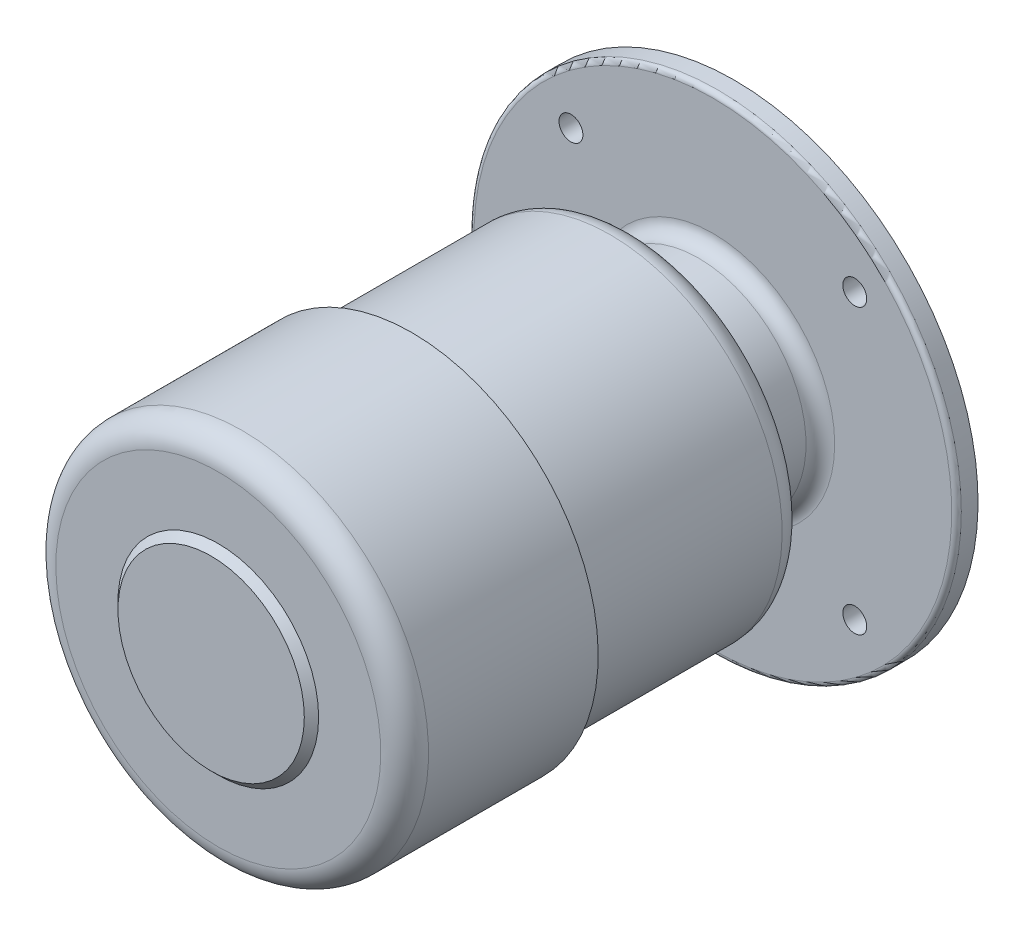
ISO-10303-21;
HEADER;
FILE_DESCRIPTION(('STEP AP214'),'2;1');
FILE_NAME('part.step','',(''),(''),'','','');
FILE_SCHEMA(('AUTOMOTIVE_DESIGN { 1 0 10303 214 1 1 1 1 }'));
ENDSEC;
DATA;
#1=APPLICATION_CONTEXT('core data for automotive mechanical design processes');
#2=APPLICATION_PROTOCOL_DEFINITION('international standard','automotive_design',2000,#1);
#3=PRODUCT_CONTEXT('',#1,'mechanical');
#4=PRODUCT('Part','Part','',(#3));
#5=PRODUCT_RELATED_PRODUCT_CATEGORY('part','',(#4));
#6=PRODUCT_DEFINITION_FORMATION('','',#4);
#7=PRODUCT_DEFINITION_CONTEXT('part definition',#1,'design');
#8=PRODUCT_DEFINITION('design','',#6,#7);
#9=PRODUCT_DEFINITION_SHAPE('','',#8);
#10=(LENGTH_UNIT() NAMED_UNIT(*) SI_UNIT(.MILLI.,.METRE.));
#11=(NAMED_UNIT(*) PLANE_ANGLE_UNIT() SI_UNIT($,.RADIAN.));
#12=(NAMED_UNIT(*) SI_UNIT($,.STERADIAN.) SOLID_ANGLE_UNIT());
#13=UNCERTAINTY_MEASURE_WITH_UNIT(LENGTH_MEASURE(1.E-05),#10,'distance_accuracy_value','');
#14=(GEOMETRIC_REPRESENTATION_CONTEXT(3) GLOBAL_UNCERTAINTY_ASSIGNED_CONTEXT((#13)) GLOBAL_UNIT_ASSIGNED_CONTEXT((#10,
#11,#12)) REPRESENTATION_CONTEXT('',''));
#15=CARTESIAN_POINT('',(0.,0.,0.));
#16=DIRECTION('',(0.,0.,1.));
#17=DIRECTION('',(1.,0.,0.));
#18=AXIS2_PLACEMENT_3D('',#15,#16,#17);
#19=CARTESIAN_POINT('',(78.,0.,226.));
#20=DIRECTION('',(0.,0.,1.));
#21=DIRECTION('',(0.,-1.,0.));
#22=AXIS2_PLACEMENT_3D('',#19,#20,#21);
#23=PLANE('',#22);
#24=CARTESIAN_POINT('',(0.,0.,226.));
#25=DIRECTION('',(0.,0.,1.));
#26=DIRECTION('',(0.,-1.,0.));
#27=AXIS2_PLACEMENT_3D('',#24,#25,#26);
#28=CIRCLE('',#27,68.);
#29=CARTESIAN_POINT('',(0.,-68.,226.));
#30=VERTEX_POINT('',#29);
#31=EDGE_CURVE('E11',#30,#30,#28,.T.);
#32=ORIENTED_EDGE('',*,*,#31,.T.);
#33=EDGE_LOOP('',(#32));
#34=FACE_BOUND('',#33,.T.);
#35=CARTESIAN_POINT('',(0.,0.,226.));
#36=DIRECTION('',(0.,0.,1.));
#37=DIRECTION('',(1.,0.,0.));
#38=AXIS2_PLACEMENT_3D('',#35,#36,#37);
#39=CIRCLE('',#38,42.0000000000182);
#40=CARTESIAN_POINT('',(42.0000000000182,0.,226.));
#41=VERTEX_POINT('',#40);
#42=EDGE_CURVE('E483',#41,#41,#39,.T.);
#43=ORIENTED_EDGE('',*,*,#42,.F.);
#44=EDGE_LOOP('',(#43));
#45=FACE_BOUND('',#44,.T.);
#46=ADVANCED_FACE('F31',(#34,#45),#23,.T.);
#47=CARTESIAN_POINT('',(0.,0.,4.));
#48=DIRECTION('',(0.,0.,-1.));
#49=DIRECTION('',(0.,1.,0.));
#50=AXIS2_PLACEMENT_3D('',#47,#48,#49);
#51=PLANE('',#50);
#52=CARTESIAN_POINT('',(0.,0.,4.));
#53=DIRECTION('',(0.,0.,-1.));
#54=DIRECTION('',(0.,1.,0.));
#55=AXIS2_PLACEMENT_3D('',#52,#53,#54);
#56=CIRCLE('',#55,66.);
#57=CARTESIAN_POINT('',(0.,66.,4.));
#58=VERTEX_POINT('',#57);
#59=EDGE_CURVE('E122',#58,#58,#56,.T.);
#60=ORIENTED_EDGE('',*,*,#59,.T.);
#61=EDGE_LOOP('',(#60));
#62=FACE_BOUND('',#61,.T.);
#63=DIRECTION('',(-0.707106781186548,0.707106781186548,0.));
#64=VECTOR('',#63,1.);
#65=CARTESIAN_POINT('',(-6.09451801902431,10.3371587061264,4.));
#66=LINE('',#65,#64);
#67=CARTESIAN_POINT('',(-2.12132034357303,6.36396103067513,4.));
#68=VERTEX_POINT('',#67);
#69=CARTESIAN_POINT('',(-6.09451801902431,10.3371587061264,4.));
#70=VERTEX_POINT('',#69);
#71=EDGE_CURVE('E82',#68,#70,#66,.T.);
#72=ORIENTED_EDGE('',*,*,#71,.F.);
#73=DIRECTION('',(0.707106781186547,0.707106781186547,0.));
#74=VECTOR('',#73,1.);
#75=CARTESIAN_POINT('',(-2.12132034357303,6.36396103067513,4.));
#76=LINE('',#75,#74);
#77=CARTESIAN_POINT('',(-6.36396103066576,2.12132034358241,4.));
#78=VERTEX_POINT('',#77);
#79=EDGE_CURVE('E94',#78,#68,#76,.T.);
#80=ORIENTED_EDGE('',*,*,#79,.F.);
#81=DIRECTION('',(0.707106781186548,-0.707106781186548,0.));
#82=VECTOR('',#81,1.);
#83=CARTESIAN_POINT('',(-6.36396103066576,2.12132034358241,4.));
#84=LINE('',#83,#82);
#85=CARTESIAN_POINT('',(-10.3371587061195,6.0945180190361,4.));
#86=VERTEX_POINT('',#85);
#87=EDGE_CURVE('E106',#86,#78,#84,.T.);
#88=ORIENTED_EDGE('',*,*,#87,.F.);
#89=CARTESIAN_POINT('',(0.,0.,4.));
#90=DIRECTION('',(0.,0.,-1.));
#91=DIRECTION('',(0.,-1.,0.));
#92=AXIS2_PLACEMENT_3D('',#89,#90,#91);
#93=CIRCLE('',#92,11.999999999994);
#94=EDGE_CURVE('E104',#70,#86,#93,.T.);
#95=ORIENTED_EDGE('',*,*,#94,.F.);
#96=EDGE_LOOP('',(#72,#80,#88,#95));
#97=FACE_BOUND('',#96,.T.);
#98=ADVANCED_FACE('F102',(#62,#97),#51,.T.);
#99=CARTESIAN_POINT('',(0.,0.,10.));
#100=DIRECTION('',(0.,0.,-1.));
#101=DIRECTION('',(0.,1.,0.));
#102=AXIS2_PLACEMENT_3D('',#99,#100,#101);
#103=PLANE('',#102);
#104=CARTESIAN_POINT('',(-59.3969696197,59.3969696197,10.));
#105=DIRECTION('',(0.,0.,-1.));
#106=DIRECTION('',(0.,1.,0.));
#107=AXIS2_PLACEMENT_3D('',#104,#105,#106);
#108=CIRCLE('',#107,4.99999999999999);
#109=CARTESIAN_POINT('',(-59.3969696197,64.3969696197,10.));
#110=VERTEX_POINT('',#109);
#111=EDGE_CURVE('E499',#110,#110,#108,.T.);
#112=ORIENTED_EDGE('',*,*,#111,.F.);
#113=EDGE_LOOP('',(#112));
#114=FACE_BOUND('',#113,.T.);
#115=CARTESIAN_POINT('',(-59.3969696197,-59.3969696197,10.));
#116=DIRECTION('',(0.,0.,-1.));
#117=DIRECTION('',(0.,1.,0.));
#118=AXIS2_PLACEMENT_3D('',#115,#116,#117);
#119=CIRCLE('',#118,4.99999999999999);
#120=CARTESIAN_POINT('',(-59.3969696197,-54.3969696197,10.));
#121=VERTEX_POINT('',#120);
#122=EDGE_CURVE('E495',#121,#121,#119,.T.);
#123=ORIENTED_EDGE('',*,*,#122,.F.);
#124=EDGE_LOOP('',(#123));
#125=FACE_BOUND('',#124,.T.);
#126=CARTESIAN_POINT('',(59.3969696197,59.3969696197,10.));
#127=DIRECTION('',(0.,0.,-1.));
#128=DIRECTION('',(0.,1.,0.));
#129=AXIS2_PLACEMENT_3D('',#126,#127,#128);
#130=CIRCLE('',#129,4.99999999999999);
#131=CARTESIAN_POINT('',(59.3969696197,64.3969696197,10.));
#132=VERTEX_POINT('',#131);
#133=EDGE_CURVE('E480',#132,#132,#130,.T.);
#134=ORIENTED_EDGE('',*,*,#133,.F.);
#135=EDGE_LOOP('',(#134));
#136=FACE_BOUND('',#135,.T.);
#137=CARTESIAN_POINT('',(59.3969696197,-59.3969696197,10.));
#138=DIRECTION('',(0.,0.,-1.));
#139=DIRECTION('',(0.,1.,0.));
#140=AXIS2_PLACEMENT_3D('',#137,#138,#139);
#141=CIRCLE('',#140,4.99999999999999);
#142=CARTESIAN_POINT('',(59.3969696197,-54.3969696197,10.));
#143=VERTEX_POINT('',#142);
#144=EDGE_CURVE('E479',#143,#143,#141,.T.);
#145=ORIENTED_EDGE('',*,*,#144,.F.);
#146=EDGE_LOOP('',(#145));
#147=FACE_BOUND('',#146,.T.);
#148=CARTESIAN_POINT('',(0.,0.,10.));
#149=DIRECTION('',(0.,0.,-1.));
#150=DIRECTION('',(0.,1.,0.));
#151=AXIS2_PLACEMENT_3D('',#148,#149,#150);
#152=CIRCLE('',#151,102.);
#153=CARTESIAN_POINT('',(0.,102.,10.));
#154=VERTEX_POINT('',#153);
#155=EDGE_CURVE('E125',#154,#154,#152,.T.);
#156=ORIENTED_EDGE('',*,*,#155,.T.);
#157=EDGE_LOOP('',(#156));
#158=FACE_BOUND('',#157,.T.);
#159=CARTESIAN_POINT('',(0.,0.,10.));
#160=DIRECTION('',(0.,0.,-1.));
#161=DIRECTION('',(0.,1.,0.));
#162=AXIS2_PLACEMENT_3D('',#159,#160,#161);
#163=CIRCLE('',#162,66.);
#164=CARTESIAN_POINT('',(0.,66.,10.));
#165=VERTEX_POINT('',#164);
#166=EDGE_CURVE('E89',#165,#165,#163,.T.);
#167=ORIENTED_EDGE('',*,*,#166,.F.);
#168=EDGE_LOOP('',(#167));
#169=FACE_BOUND('',#168,.T.);
#170=ADVANCED_FACE('F213',(#114,#125,#136,#147,#158,#169),#103,.T.);
#171=CARTESIAN_POINT('',(0.,0.,226.));
#172=DIRECTION('',(0.,0.,-1.));
#173=DIRECTION('',(0.,1.,0.));
#174=AXIS2_PLACEMENT_3D('',#171,#172,#173);
#175=CYLINDRICAL_SURFACE('',#174,78.);
#176=CARTESIAN_POINT('',(0.,0.,216.));
#177=DIRECTION('',(0.,0.,1.));
#178=DIRECTION('',(0.,-1.,0.));
#179=AXIS2_PLACEMENT_3D('',#176,#177,#178);
#180=CIRCLE('',#179,78.);
#181=CARTESIAN_POINT('',(0.,-78.,216.));
#182=VERTEX_POINT('',#181);
#183=EDGE_CURVE('E39',#182,#182,#180,.F.);
#184=ORIENTED_EDGE('',*,*,#183,.T.);
#185=EDGE_LOOP('',(#184));
#186=FACE_BOUND('',#185,.T.);
#187=CARTESIAN_POINT('',(0.,0.,145.));
#188=DIRECTION('',(0.,0.,-1.));
#189=DIRECTION('',(0.,1.,0.));
#190=AXIS2_PLACEMENT_3D('',#187,#188,#189);
#191=CIRCLE('',#190,78.);
#192=CARTESIAN_POINT('',(0.,78.,145.));
#193=VERTEX_POINT('',#192);
#194=EDGE_CURVE('E131',#193,#193,#191,.T.);
#195=ORIENTED_EDGE('',*,*,#194,.F.);
#196=EDGE_LOOP('',(#195));
#197=FACE_BOUND('',#196,.T.);
#198=ADVANCED_FACE('F33',(#186,#197),#175,.T.);
#199=CARTESIAN_POINT('',(72.,0.,145.));
#200=DIRECTION('',(0.,0.,-1.));
#201=DIRECTION('',(0.,1.,0.));
#202=AXIS2_PLACEMENT_3D('',#199,#200,#201);
#203=PLANE('',#202);
#204=ORIENTED_EDGE('',*,*,#194,.T.);
#205=EDGE_LOOP('',(#204));
#206=FACE_BOUND('',#205,.T.);
#207=CARTESIAN_POINT('',(0.,0.,145.));
#208=DIRECTION('',(0.,0.,-1.));
#209=DIRECTION('',(0.,1.,0.));
#210=AXIS2_PLACEMENT_3D('',#207,#208,#209);
#211=CIRCLE('',#210,72.);
#212=CARTESIAN_POINT('',(0.,72.,145.));
#213=VERTEX_POINT('',#212);
#214=EDGE_CURVE('E128',#213,#213,#211,.T.);
#215=ORIENTED_EDGE('',*,*,#214,.F.);
#216=EDGE_LOOP('',(#215));
#217=FACE_BOUND('',#216,.T.);
#218=ADVANCED_FACE('F240',(#206,#217),#203,.T.);
#219=CARTESIAN_POINT('',(0.,0.,226.));
#220=DIRECTION('',(0.,0.,-1.));
#221=DIRECTION('',(0.,1.,0.));
#222=AXIS2_PLACEMENT_3D('',#219,#220,#221);
#223=CYLINDRICAL_SURFACE('',#222,72.);
#224=CARTESIAN_POINT('',(0.,0.,62.));
#225=DIRECTION('',(0.,0.,-1.));
#226=DIRECTION('',(0.,1.,0.));
#227=AXIS2_PLACEMENT_3D('',#224,#225,#226);
#228=CIRCLE('',#227,72.);
#229=CARTESIAN_POINT('',(0.,72.,62.));
#230=VERTEX_POINT('',#229);
#231=EDGE_CURVE('E188',#230,#230,#228,.F.);
#232=ORIENTED_EDGE('',*,*,#231,.T.);
#233=EDGE_LOOP('',(#232));
#234=FACE_BOUND('',#233,.T.);
#235=ORIENTED_EDGE('',*,*,#214,.T.);
#236=EDGE_LOOP('',(#235));
#237=FACE_BOUND('',#236,.T.);
#238=ADVANCED_FACE('F237',(#234,#237),#223,.T.);
#239=CARTESIAN_POINT('',(45.,0.,52.));
#240=DIRECTION('',(0.,0.,-1.));
#241=DIRECTION('',(0.,1.,0.));
#242=AXIS2_PLACEMENT_3D('',#239,#240,#241);
#243=PLANE('',#242);
#244=CARTESIAN_POINT('',(0.,0.,52.));
#245=DIRECTION('',(0.,0.,-1.));
#246=DIRECTION('',(0.,1.,0.));
#247=AXIS2_PLACEMENT_3D('',#244,#245,#246);
#248=CIRCLE('',#247,62.);
#249=CARTESIAN_POINT('',(0.,62.,52.));
#250=VERTEX_POINT('',#249);
#251=EDGE_CURVE('E185',#250,#250,#248,.T.);
#252=ORIENTED_EDGE('',*,*,#251,.T.);
#253=EDGE_LOOP('',(#252));
#254=FACE_BOUND('',#253,.T.);
#255=CARTESIAN_POINT('',(0.,0.,52.));
#256=DIRECTION('',(0.,0.,-1.));
#257=DIRECTION('',(0.,1.,0.));
#258=AXIS2_PLACEMENT_3D('',#255,#256,#257);
#259=CIRCLE('',#258,51.);
#260=CARTESIAN_POINT('',(0.,51.,52.));
#261=VERTEX_POINT('',#260);
#262=EDGE_CURVE('E176',#261,#261,#259,.F.);
#263=ORIENTED_EDGE('',*,*,#262,.T.);
#264=EDGE_LOOP('',(#263));
#265=FACE_BOUND('',#264,.T.);
#266=ADVANCED_FACE('F233',(#254,#265),#243,.T.);
#267=CARTESIAN_POINT('',(0.,0.,226.));
#268=DIRECTION('',(0.,0.,-1.));
#269=DIRECTION('',(0.,1.,0.));
#270=AXIS2_PLACEMENT_3D('',#267,#268,#269);
#271=CYLINDRICAL_SURFACE('',#270,45.);
#272=CARTESIAN_POINT('',(0.,0.,25.));
#273=DIRECTION('',(0.,0.,1.));
#274=DIRECTION('',(0.,-1.,0.));
#275=AXIS2_PLACEMENT_3D('',#272,#273,#274);
#276=CIRCLE('',#275,45.);
#277=CARTESIAN_POINT('',(0.,-45.,25.));
#278=VERTEX_POINT('',#277);
#279=EDGE_CURVE('E182',#278,#278,#276,.T.);
#280=ORIENTED_EDGE('',*,*,#279,.T.);
#281=EDGE_LOOP('',(#280));
#282=FACE_BOUND('',#281,.T.);
#283=CARTESIAN_POINT('',(0.,0.,46.));
#284=DIRECTION('',(0.,0.,-1.));
#285=DIRECTION('',(0.,1.,0.));
#286=AXIS2_PLACEMENT_3D('',#283,#284,#285);
#287=CIRCLE('',#286,45.);
#288=CARTESIAN_POINT('',(0.,45.,46.));
#289=VERTEX_POINT('',#288);
#290=EDGE_CURVE('E173',#289,#289,#287,.T.);
#291=ORIENTED_EDGE('',*,*,#290,.T.);
#292=EDGE_LOOP('',(#291));
#293=FACE_BOUND('',#292,.T.);
#294=ADVANCED_FACE('F229',(#282,#293),#271,.T.);
#295=CARTESIAN_POINT('',(102.,0.,19.));
#296=DIRECTION('',(0.,0.,1.));
#297=DIRECTION('',(0.,-1.,0.));
#298=AXIS2_PLACEMENT_3D('',#295,#296,#297);
#299=PLANE('',#298);
#300=CARTESIAN_POINT('',(0.,0.,19.));
#301=DIRECTION('',(0.,0.,1.));
#302=DIRECTION('',(0.,-1.,0.));
#303=AXIS2_PLACEMENT_3D('',#300,#301,#302);
#304=CIRCLE('',#303,51.);
#305=CARTESIAN_POINT('',(0.,-51.,19.));
#306=VERTEX_POINT('',#305);
#307=EDGE_CURVE('E179',#306,#306,#304,.F.);
#308=ORIENTED_EDGE('',*,*,#307,.T.);
#309=EDGE_LOOP('',(#308));
#310=FACE_BOUND('',#309,.T.);
#311=CARTESIAN_POINT('',(0.,0.,19.));
#312=DIRECTION('',(0.,0.,1.));
#313=DIRECTION('',(0.,-1.,0.));
#314=AXIS2_PLACEMENT_3D('',#311,#312,#313);
#315=CIRCLE('',#314,100.);
#316=CARTESIAN_POINT('',(0.,-100.,19.));
#317=VERTEX_POINT('',#316);
#318=EDGE_CURVE('E170',#317,#317,#315,.T.);
#319=ORIENTED_EDGE('',*,*,#318,.T.);
#320=EDGE_LOOP('',(#319));
#321=FACE_BOUND('',#320,.T.);
#322=CARTESIAN_POINT('',(-59.3969696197,59.3969696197,19.));
#323=DIRECTION('',(0.,0.,1.));
#324=DIRECTION('',(1.,0.,0.));
#325=AXIS2_PLACEMENT_3D('',#322,#323,#324);
#326=CIRCLE('',#325,4.99999999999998);
#327=CARTESIAN_POINT('',(-54.3969696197,59.3969696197,19.));
#328=VERTEX_POINT('',#327);
#329=EDGE_CURVE('E467',#328,#328,#326,.T.);
#330=ORIENTED_EDGE('',*,*,#329,.F.);
#331=EDGE_LOOP('',(#330));
#332=FACE_BOUND('',#331,.T.);
#333=CARTESIAN_POINT('',(-59.3969696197,-59.3969696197,19.));
#334=DIRECTION('',(0.,0.,1.));
#335=DIRECTION('',(1.,0.,0.));
#336=AXIS2_PLACEMENT_3D('',#333,#334,#335);
#337=CIRCLE('',#336,4.99999999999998);
#338=CARTESIAN_POINT('',(-54.3969696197,-59.3969696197,19.));
#339=VERTEX_POINT('',#338);
#340=EDGE_CURVE('E471',#339,#339,#337,.T.);
#341=ORIENTED_EDGE('',*,*,#340,.F.);
#342=EDGE_LOOP('',(#341));
#343=FACE_BOUND('',#342,.T.);
#344=CARTESIAN_POINT('',(59.3969696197,59.3969696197,19.));
#345=DIRECTION('',(0.,0.,1.));
#346=DIRECTION('',(1.,0.,0.));
#347=AXIS2_PLACEMENT_3D('',#344,#345,#346);
#348=CIRCLE('',#347,4.99999999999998);
#349=CARTESIAN_POINT('',(64.3969696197,59.3969696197,19.));
#350=VERTEX_POINT('',#349);
#351=EDGE_CURVE('E475',#350,#350,#348,.T.);
#352=ORIENTED_EDGE('',*,*,#351,.F.);
#353=EDGE_LOOP('',(#352));
#354=FACE_BOUND('',#353,.T.);
#355=CARTESIAN_POINT('',(59.3969696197,-59.3969696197,19.));
#356=DIRECTION('',(0.,0.,1.));
#357=DIRECTION('',(1.,0.,0.));
#358=AXIS2_PLACEMENT_3D('',#355,#356,#357);
#359=CIRCLE('',#358,4.99999999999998);
#360=CARTESIAN_POINT('',(64.3969696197,-59.3969696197,19.));
#361=VERTEX_POINT('',#360);
#362=EDGE_CURVE('E478',#361,#361,#359,.T.);
#363=ORIENTED_EDGE('',*,*,#362,.F.);
#364=EDGE_LOOP('',(#363));
#365=FACE_BOUND('',#364,.T.);
#366=ADVANCED_FACE('F225',(#310,#321,#332,#343,#354,#365),#299,.T.);
#367=CARTESIAN_POINT('',(0.,0.,226.));
#368=DIRECTION('',(0.,0.,-1.));
#369=DIRECTION('',(0.,1.,0.));
#370=AXIS2_PLACEMENT_3D('',#367,#368,#369);
#371=CYLINDRICAL_SURFACE('',#370,102.);
#372=CARTESIAN_POINT('',(0.,0.,17.));
#373=DIRECTION('',(0.,0.,1.));
#374=DIRECTION('',(0.,-1.,0.));
#375=AXIS2_PLACEMENT_3D('',#372,#373,#374);
#376=CIRCLE('',#375,102.);
#377=CARTESIAN_POINT('',(0.,-102.,17.));
#378=VERTEX_POINT('',#377);
#379=EDGE_CURVE('E167',#378,#378,#376,.F.);
#380=ORIENTED_EDGE('',*,*,#379,.T.);
#381=EDGE_LOOP('',(#380));
#382=FACE_BOUND('',#381,.T.);
#383=ORIENTED_EDGE('',*,*,#155,.F.);
#384=EDGE_LOOP('',(#383));
#385=FACE_BOUND('',#384,.T.);
#386=ADVANCED_FACE('F222',(#382,#385),#371,.T.);
#387=CARTESIAN_POINT('',(0.,0.,4.));
#388=DIRECTION('',(0.,0.,1.));
#389=DIRECTION('',(0.,-1.,0.));
#390=AXIS2_PLACEMENT_3D('',#387,#388,#389);
#391=CYLINDRICAL_SURFACE('',#390,66.);
#392=ORIENTED_EDGE('',*,*,#59,.F.);
#393=EDGE_LOOP('',(#392));
#394=FACE_BOUND('',#393,.T.);
#395=ORIENTED_EDGE('',*,*,#166,.T.);
#396=EDGE_LOOP('',(#395));
#397=FACE_BOUND('',#396,.T.);
#398=ADVANCED_FACE('F218',(#394,#397),#391,.T.);
#399=CARTESIAN_POINT('',(-2.12132034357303,6.36396103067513,-32.));
#400=DIRECTION('',(0.707106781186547,-0.707106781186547,0.));
#401=DIRECTION('',(0.707106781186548,0.707106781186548,0.));
#402=AXIS2_PLACEMENT_3D('',#399,#400,#401);
#403=PLANE('',#402);
#404=ORIENTED_EDGE('',*,*,#79,.T.);
#405=DIRECTION('',(0.,0.,1.));
#406=VECTOR('',#405,1.);
#407=CARTESIAN_POINT('',(-2.12132034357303,6.36396103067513,-32.));
#408=LINE('',#407,#406);
#409=CARTESIAN_POINT('',(-2.12132034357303,6.36396103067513,-32.));
#410=VERTEX_POINT('',#409);
#411=EDGE_CURVE('E78',#410,#68,#408,.T.);
#412=ORIENTED_EDGE('',*,*,#411,.F.);
#413=DIRECTION('',(0.707106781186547,0.707106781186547,0.));
#414=VECTOR('',#413,1.);
#415=CARTESIAN_POINT('',(-2.12132034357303,6.36396103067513,-32.));
#416=LINE('',#415,#414);
#417=CARTESIAN_POINT('',(-6.36396103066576,2.12132034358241,-32.));
#418=VERTEX_POINT('',#417);
#419=EDGE_CURVE('E111',#418,#410,#416,.T.);
#420=ORIENTED_EDGE('',*,*,#419,.F.);
#421=DIRECTION('',(0.,0.,1.));
#422=VECTOR('',#421,1.);
#423=CARTESIAN_POINT('',(-6.36396103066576,2.12132034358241,-32.));
#424=LINE('',#423,#422);
#425=EDGE_CURVE('E97',#418,#78,#424,.T.);
#426=ORIENTED_EDGE('',*,*,#425,.T.);
#427=EDGE_LOOP('',(#404,#412,#420,#426));
#428=FACE_BOUND('',#427,.T.);
#429=ADVANCED_FACE('F95',(#428),#403,.F.);
#430=CARTESIAN_POINT('',(-6.09451801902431,10.3371587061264,-32.));
#431=DIRECTION('',(0.707106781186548,0.707106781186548,0.));
#432=DIRECTION('',(-0.707106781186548,0.707106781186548,0.));
#433=AXIS2_PLACEMENT_3D('',#430,#431,#432);
#434=PLANE('',#433);
#435=DIRECTION('',(0.,0.,1.));
#436=VECTOR('',#435,1.);
#437=CARTESIAN_POINT('',(-6.09451801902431,10.3371587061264,-32.));
#438=LINE('',#437,#436);
#439=CARTESIAN_POINT('',(-6.09451801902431,10.3371587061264,-30.0000000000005));
#440=VERTEX_POINT('',#439);
#441=EDGE_CURVE('E90',#440,#70,#438,.T.);
#442=ORIENTED_EDGE('',*,*,#441,.F.);
#443=CARTESIAN_POINT('',(-6.09451801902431,10.3371587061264,-30.0000000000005));
#444=CARTESIAN_POINT('',(-5.97237529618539,10.2150159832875,-30.1672487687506));
#445=CARTESIAN_POINT('',(-5.85015159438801,10.0927922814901,-30.3343793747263));
#446=CARTESIAN_POINT('',(-5.6055164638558,9.84815715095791,-30.6683643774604));
#447=CARTESIAN_POINT('',(-5.48310503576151,9.72574572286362,-30.8352187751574));
#448=CARTESIAN_POINT('',(-5.2380677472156,9.48070843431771,-31.168612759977));
#449=CARTESIAN_POINT('',(-5.11544188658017,9.35808257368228,-31.3351523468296));
#450=CARTESIAN_POINT('',(-4.86994076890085,9.11258145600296,-31.6678646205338));
#451=CARTESIAN_POINT('',(-4.74706551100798,8.98970619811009,-31.8340373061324));
#452=CARTESIAN_POINT('',(-4.62404843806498,8.8666891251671,-32.));
#453=B_SPLINE_CURVE_WITH_KNOTS('',3,(#443,#444,#445,#446,#447,#448,#449,#450,#451,#452),
.UNSPECIFIED.,.F.,.F.,(4,2,2,2,4),(0.,0.72131036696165,1.44261827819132,2.16392680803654,
2.88523779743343),.UNSPECIFIED.);
#454=CARTESIAN_POINT('',(-4.62404843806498,8.8666891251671,-32.));
#455=VERTEX_POINT('',#454);
#456=EDGE_CURVE('E162',#440,#455,#453,.T.);
#457=ORIENTED_EDGE('',*,*,#456,.T.);
#458=DIRECTION('',(-0.707106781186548,0.707106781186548,0.));
#459=VECTOR('',#458,1.);
#460=CARTESIAN_POINT('',(-6.09451801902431,10.3371587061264,-32.));
#461=LINE('',#460,#459);
#462=EDGE_CURVE('E85',#410,#455,#461,.T.);
#463=ORIENTED_EDGE('',*,*,#462,.F.);
#464=ORIENTED_EDGE('',*,*,#411,.T.);
#465=ORIENTED_EDGE('',*,*,#71,.T.);
#466=EDGE_LOOP('',(#442,#457,#463,#464,#465));
#467=FACE_BOUND('',#466,.T.);
#468=ADVANCED_FACE('F80',(#467),#434,.F.);
#469=CARTESIAN_POINT('',(0.,0.,-32.));
#470=DIRECTION('',(0.,0.,1.));
#471=DIRECTION('',(0.,-1.,0.));
#472=AXIS2_PLACEMENT_3D('',#469,#470,#471);
#473=CYLINDRICAL_SURFACE('',#472,11.999999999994);
#474=DIRECTION('',(0.,0.,1.));
#475=VECTOR('',#474,1.);
#476=CARTESIAN_POINT('',(-10.3371587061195,6.0945180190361,-32.));
#477=LINE('',#476,#475);
#478=CARTESIAN_POINT('',(-10.3371587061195,6.0945180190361,-30.0000000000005));
#479=VERTEX_POINT('',#478);
#480=EDGE_CURVE('E117',#479,#86,#477,.T.);
#481=ORIENTED_EDGE('',*,*,#480,.F.);
#482=CARTESIAN_POINT('',(0.,0.,-30.0000000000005));
#483=DIRECTION('',(0.,0.,1.));
#484=DIRECTION('',(1.,0.,0.));
#485=AXIS2_PLACEMENT_3D('',#482,#483,#484);
#486=CIRCLE('',#485,11.999999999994);
#487=EDGE_CURVE('E46',#479,#440,#486,.T.);
#488=ORIENTED_EDGE('',*,*,#487,.T.);
#489=ORIENTED_EDGE('',*,*,#441,.T.);
#490=ORIENTED_EDGE('',*,*,#94,.T.);
#491=EDGE_LOOP('',(#481,#488,#489,#490));
#492=FACE_BOUND('',#491,.T.);
#493=ADVANCED_FACE('F154',(#492),#473,.T.);
#494=CARTESIAN_POINT('',(-6.36396103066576,2.12132034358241,-32.));
#495=DIRECTION('',(-0.707106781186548,-0.707106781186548,0.));
#496=DIRECTION('',(0.707106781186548,-0.707106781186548,0.));
#497=AXIS2_PLACEMENT_3D('',#494,#495,#496);
#498=PLANE('',#497);
#499=DIRECTION('',(0.707106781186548,-0.707106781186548,0.));
#500=VECTOR('',#499,1.);
#501=CARTESIAN_POINT('',(-6.36396103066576,2.12132034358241,-32.));
#502=LINE('',#501,#500);
#503=CARTESIAN_POINT('',(-8.86668912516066,4.6240484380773,-32.));
#504=VERTEX_POINT('',#503);
#505=EDGE_CURVE('E114',#504,#418,#502,.T.);
#506=ORIENTED_EDGE('',*,*,#505,.F.);
#507=CARTESIAN_POINT('',(-8.86668912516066,4.6240484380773,-32.));
#508=CARTESIAN_POINT('',(-8.9897061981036,4.74706551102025,-31.8340373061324));
#509=CARTESIAN_POINT('',(-9.11258145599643,4.86994076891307,-31.6678646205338));
#510=CARTESIAN_POINT('',(-9.35808257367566,5.1154418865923,-31.3351523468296));
#511=CARTESIAN_POINT('',(-9.48070843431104,5.23806774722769,-31.168612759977));
#512=CARTESIAN_POINT('',(-9.72574572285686,5.48310503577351,-30.8352187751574));
#513=CARTESIAN_POINT('',(-9.84815715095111,5.60551646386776,-30.6683643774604));
#514=CARTESIAN_POINT('',(-10.0927922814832,5.85015159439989,-30.3343793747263));
#515=CARTESIAN_POINT('',(-10.2150159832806,5.97237529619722,-30.1672487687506));
#516=CARTESIAN_POINT('',(-10.3371587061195,6.0945180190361,-30.0000000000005));
#517=B_SPLINE_CURVE_WITH_KNOTS('',3,(#507,#508,#509,#510,#511,#512,#513,#514,#515,#516),
.UNSPECIFIED.,.F.,.F.,(4,2,2,2,4),(0.,0.721310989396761,1.44261951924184,2.16392743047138,
2.8852377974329),.UNSPECIFIED.);
#518=EDGE_CURVE('E54',#504,#479,#517,.T.);
#519=ORIENTED_EDGE('',*,*,#518,.T.);
#520=ORIENTED_EDGE('',*,*,#480,.T.);
#521=ORIENTED_EDGE('',*,*,#87,.T.);
#522=ORIENTED_EDGE('',*,*,#425,.F.);
#523=EDGE_LOOP('',(#506,#519,#520,#521,#522));
#524=FACE_BOUND('',#523,.T.);
#525=ADVANCED_FACE('F148',(#524),#498,.F.);
#526=CARTESIAN_POINT('',(0.,0.,-32.));
#527=DIRECTION('',(0.,0.,1.));
#528=DIRECTION('',(0.,-1.,0.));
#529=AXIS2_PLACEMENT_3D('',#526,#527,#528);
#530=PLANE('',#529);
#531=ORIENTED_EDGE('',*,*,#462,.T.);
#532=CARTESIAN_POINT('',(0.,0.,-32.));
#533=DIRECTION('',(0.,0.,1.));
#534=DIRECTION('',(0.,-1.,0.));
#535=AXIS2_PLACEMENT_3D('',#532,#533,#534);
#536=CIRCLE('',#535,9.99999999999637);
#537=EDGE_CURVE('E134',#455,#504,#536,.F.);
#538=ORIENTED_EDGE('',*,*,#537,.T.);
#539=ORIENTED_EDGE('',*,*,#505,.T.);
#540=ORIENTED_EDGE('',*,*,#419,.T.);
#541=EDGE_LOOP('',(#531,#538,#539,#540));
#542=FACE_BOUND('',#541,.T.);
#543=ADVANCED_FACE('F153',(#542),#530,.F.);
#544=CARTESIAN_POINT('',(0.,0.,226.));
#545=DIRECTION('',(0.,0.,-1.));
#546=DIRECTION('',(1.,0.,0.));
#547=AXIS2_PLACEMENT_3D('',#544,#545,#546);
#548=CONICAL_SURFACE('',#547,42.0000000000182,0.785398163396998);
#549=CARTESIAN_POINT('',(0.,0.,229.));
#550=DIRECTION('',(0.,0.,1.));
#551=DIRECTION('',(1.,0.,0.));
#552=AXIS2_PLACEMENT_3D('',#549,#550,#551);
#553=CIRCLE('',#552,39.0000000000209);
#554=CARTESIAN_POINT('',(39.0000000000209,0.,229.));
#555=VERTEX_POINT('',#554);
#556=EDGE_CURVE('E100',#555,#555,#553,.T.);
#557=ORIENTED_EDGE('',*,*,#556,.F.);
#558=EDGE_LOOP('',(#557));
#559=FACE_BOUND('',#558,.T.);
#560=ORIENTED_EDGE('',*,*,#42,.T.);
#561=EDGE_LOOP('',(#560));
#562=FACE_BOUND('',#561,.T.);
#563=ADVANCED_FACE('F277',(#559,#562),#548,.T.);
#564=CARTESIAN_POINT('',(0.,0.,229.));
#565=DIRECTION('',(0.,0.,1.));
#566=DIRECTION('',(1.,0.,0.));
#567=AXIS2_PLACEMENT_3D('',#564,#565,#566);
#568=PLANE('',#567);
#569=ORIENTED_EDGE('',*,*,#556,.T.);
#570=EDGE_LOOP('',(#569));
#571=FACE_BOUND('',#570,.T.);
#572=ADVANCED_FACE('F283',(#571),#568,.T.);
#573=CARTESIAN_POINT('',(59.3969696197,-59.3969696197,19.));
#574=DIRECTION('',(0.,0.,1.));
#575=DIRECTION('',(1.,0.,0.));
#576=AXIS2_PLACEMENT_3D('',#573,#574,#575);
#577=CYLINDRICAL_SURFACE('',#576,4.99999999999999);
#578=ORIENTED_EDGE('',*,*,#362,.T.);
#579=EDGE_LOOP('',(#578));
#580=FACE_BOUND('',#579,.T.);
#581=ORIENTED_EDGE('',*,*,#144,.T.);
#582=EDGE_LOOP('',(#581));
#583=FACE_BOUND('',#582,.T.);
#584=ADVANCED_FACE('F291',(#580,#583),#577,.F.);
#585=CARTESIAN_POINT('',(59.3969696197,59.3969696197,19.));
#586=DIRECTION('',(0.,0.,1.));
#587=DIRECTION('',(1.,0.,0.));
#588=AXIS2_PLACEMENT_3D('',#585,#586,#587);
#589=CYLINDRICAL_SURFACE('',#588,4.99999999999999);
#590=ORIENTED_EDGE('',*,*,#351,.T.);
#591=EDGE_LOOP('',(#590));
#592=FACE_BOUND('',#591,.T.);
#593=ORIENTED_EDGE('',*,*,#133,.T.);
#594=EDGE_LOOP('',(#593));
#595=FACE_BOUND('',#594,.T.);
#596=ADVANCED_FACE('F300',(#592,#595),#589,.F.);
#597=CARTESIAN_POINT('',(-59.3969696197,-59.3969696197,19.));
#598=DIRECTION('',(0.,0.,1.));
#599=DIRECTION('',(1.,0.,0.));
#600=AXIS2_PLACEMENT_3D('',#597,#598,#599);
#601=CYLINDRICAL_SURFACE('',#600,4.99999999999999);
#602=ORIENTED_EDGE('',*,*,#340,.T.);
#603=EDGE_LOOP('',(#602));
#604=FACE_BOUND('',#603,.T.);
#605=ORIENTED_EDGE('',*,*,#122,.T.);
#606=EDGE_LOOP('',(#605));
#607=FACE_BOUND('',#606,.T.);
#608=ADVANCED_FACE('F309',(#604,#607),#601,.F.);
#609=CARTESIAN_POINT('',(-59.3969696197,59.3969696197,19.));
#610=DIRECTION('',(0.,0.,1.));
#611=DIRECTION('',(1.,0.,0.));
#612=AXIS2_PLACEMENT_3D('',#609,#610,#611);
#613=CYLINDRICAL_SURFACE('',#612,4.99999999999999);
#614=ORIENTED_EDGE('',*,*,#329,.T.);
#615=EDGE_LOOP('',(#614));
#616=FACE_BOUND('',#615,.T.);
#617=ORIENTED_EDGE('',*,*,#111,.T.);
#618=EDGE_LOOP('',(#617));
#619=FACE_BOUND('',#618,.T.);
#620=ADVANCED_FACE('F318',(#616,#619),#613,.F.);
#621=CARTESIAN_POINT('',(0.,0.,-32.));
#622=DIRECTION('',(0.,0.,1.));
#623=DIRECTION('',(1.,0.,0.));
#624=AXIS2_PLACEMENT_3D('',#621,#622,#623);
#625=CONICAL_SURFACE('',#624,9.99999999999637,0.785398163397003);
#626=ORIENTED_EDGE('',*,*,#456,.F.);
#627=ORIENTED_EDGE('',*,*,#487,.F.);
#628=ORIENTED_EDGE('',*,*,#518,.F.);
#629=ORIENTED_EDGE('',*,*,#537,.F.);
#630=EDGE_LOOP('',(#626,#627,#628,#629));
#631=FACE_BOUND('',#630,.T.);
#632=ADVANCED_FACE('F144',(#631),#625,.T.);
#633=CARTESIAN_POINT('',(0.,0.,17.));
#634=DIRECTION('',(0.,0.,1.));
#635=DIRECTION('',(0.,-1.,0.));
#636=AXIS2_PLACEMENT_3D('',#633,#634,#635);
#637=TOROIDAL_SURFACE('',#636,100.,2.);
#638=ORIENTED_EDGE('',*,*,#318,.F.);
#639=EDGE_LOOP('',(#638));
#640=FACE_BOUND('',#639,.T.);
#641=ORIENTED_EDGE('',*,*,#379,.F.);
#642=EDGE_LOOP('',(#641));
#643=FACE_BOUND('',#642,.T.);
#644=ADVANCED_FACE('F334',(#640,#643),#637,.T.);
#645=CARTESIAN_POINT('',(0.,0.,46.));
#646=DIRECTION('',(0.,0.,-1.));
#647=DIRECTION('',(0.,1.,0.));
#648=AXIS2_PLACEMENT_3D('',#645,#646,#647);
#649=TOROIDAL_SURFACE('',#648,51.,6.);
#650=ORIENTED_EDGE('',*,*,#262,.F.);
#651=EDGE_LOOP('',(#650));
#652=FACE_BOUND('',#651,.T.);
#653=ORIENTED_EDGE('',*,*,#290,.F.);
#654=EDGE_LOOP('',(#653));
#655=FACE_BOUND('',#654,.T.);
#656=ADVANCED_FACE('F342',(#652,#655),#649,.F.);
#657=CARTESIAN_POINT('',(0.,0.,25.));
#658=DIRECTION('',(0.,0.,1.));
#659=DIRECTION('',(0.,-1.,0.));
#660=AXIS2_PLACEMENT_3D('',#657,#658,#659);
#661=TOROIDAL_SURFACE('',#660,51.,6.);
#662=ORIENTED_EDGE('',*,*,#279,.F.);
#663=EDGE_LOOP('',(#662));
#664=FACE_BOUND('',#663,.T.);
#665=ORIENTED_EDGE('',*,*,#307,.F.);
#666=EDGE_LOOP('',(#665));
#667=FACE_BOUND('',#666,.T.);
#668=ADVANCED_FACE('F203',(#664,#667),#661,.F.);
#669=CARTESIAN_POINT('',(0.,0.,62.));
#670=DIRECTION('',(0.,0.,-1.));
#671=DIRECTION('',(0.,1.,0.));
#672=AXIS2_PLACEMENT_3D('',#669,#670,#671);
#673=TOROIDAL_SURFACE('',#672,62.,9.99999999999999);
#674=ORIENTED_EDGE('',*,*,#231,.F.);
#675=EDGE_LOOP('',(#674));
#676=FACE_BOUND('',#675,.T.);
#677=ORIENTED_EDGE('',*,*,#251,.F.);
#678=EDGE_LOOP('',(#677));
#679=FACE_BOUND('',#678,.T.);
#680=ADVANCED_FACE('F197',(#676,#679),#673,.T.);
#681=CARTESIAN_POINT('',(0.,0.,216.));
#682=DIRECTION('',(0.,0.,1.));
#683=DIRECTION('',(0.,-1.,0.));
#684=AXIS2_PLACEMENT_3D('',#681,#682,#683);
#685=TOROIDAL_SURFACE('',#684,68.,9.99999999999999);
#686=ORIENTED_EDGE('',*,*,#31,.F.);
#687=EDGE_LOOP('',(#686));
#688=FACE_BOUND('',#687,.T.);
#689=ORIENTED_EDGE('',*,*,#183,.F.);
#690=EDGE_LOOP('',(#689));
#691=FACE_BOUND('',#690,.T.);
#692=ADVANCED_FACE('F195',(#688,#691),#685,.T.);
#693=CLOSED_SHELL('',(#46,#98,#170,#198,#218,#238,#266,#294,#366,#386,#398,#429,#468,#493,#525,
#543,#563,#572,#584,#596,#608,#620,#632,#644,#656,#668,#680,#692));
#694=MANIFOLD_SOLID_BREP('B2',#693);
#695=ADVANCED_BREP_SHAPE_REPRESENTATION('',(#18,#694),#14);
#696=SHAPE_DEFINITION_REPRESENTATION(#9,#695);
ENDSEC;
END-ISO-10303-21;
